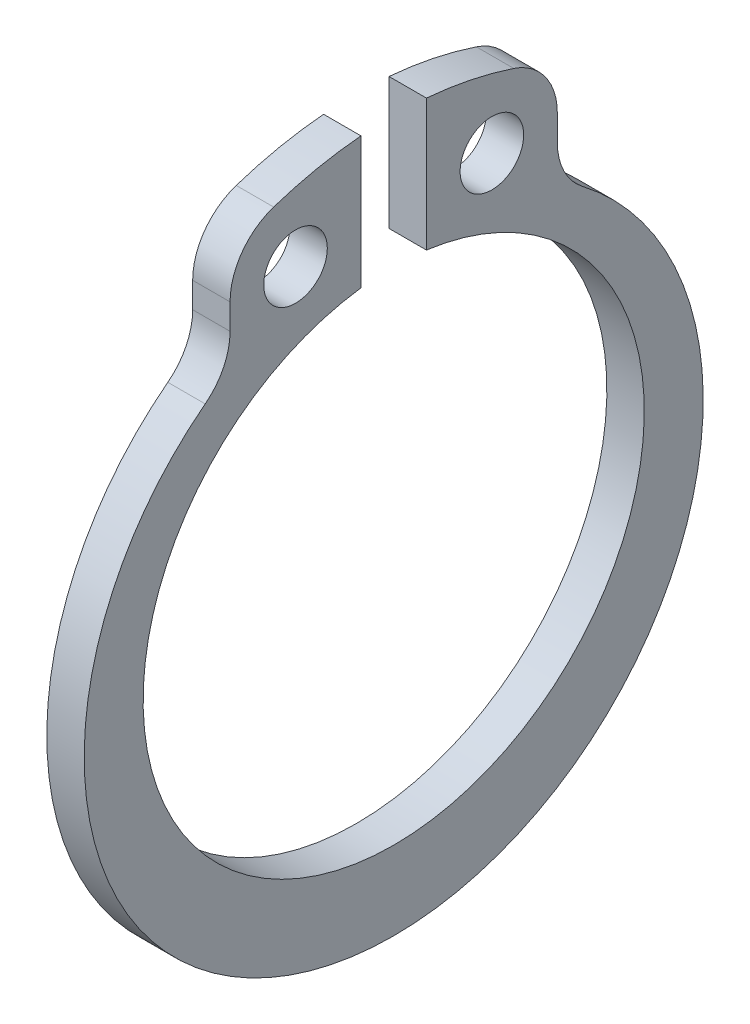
ISO-10303-21;
HEADER;
FILE_DESCRIPTION(('STEP AP214'),'2;1');
FILE_NAME('part.step','',(''),(''),'','','');
FILE_SCHEMA(('AUTOMOTIVE_DESIGN { 1 0 10303 214 1 1 1 1 }'));
ENDSEC;
DATA;
#1=APPLICATION_CONTEXT('core data for automotive mechanical design processes');
#2=APPLICATION_PROTOCOL_DEFINITION('international standard','automotive_design',2000,#1);
#3=PRODUCT_CONTEXT('',#1,'mechanical');
#4=PRODUCT('Part','Part','',(#3));
#5=PRODUCT_RELATED_PRODUCT_CATEGORY('part','',(#4));
#6=PRODUCT_DEFINITION_FORMATION('','',#4);
#7=PRODUCT_DEFINITION_CONTEXT('part definition',#1,'design');
#8=PRODUCT_DEFINITION('design','',#6,#7);
#9=PRODUCT_DEFINITION_SHAPE('','',#8);
#10=(LENGTH_UNIT() NAMED_UNIT(*) SI_UNIT(.MILLI.,.METRE.));
#11=(NAMED_UNIT(*) PLANE_ANGLE_UNIT() SI_UNIT($,.RADIAN.));
#12=(NAMED_UNIT(*) SI_UNIT($,.STERADIAN.) SOLID_ANGLE_UNIT());
#13=UNCERTAINTY_MEASURE_WITH_UNIT(LENGTH_MEASURE(1.E-05),#10,'distance_accuracy_value','');
#14=(GEOMETRIC_REPRESENTATION_CONTEXT(3) GLOBAL_UNCERTAINTY_ASSIGNED_CONTEXT((#13)) GLOBAL_UNIT_ASSIGNED_CONTEXT((#10,
#11,#12)) REPRESENTATION_CONTEXT('',''));
#15=CARTESIAN_POINT('',(0.,0.,0.));
#16=DIRECTION('',(0.,0.,1.));
#17=DIRECTION('',(1.,0.,0.));
#18=AXIS2_PLACEMENT_3D('',#15,#16,#17);
#19=CARTESIAN_POINT('',(1.,7.38670019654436,6.07500000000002));
#20=DIRECTION('',(-1.,0.,0.));
#21=DIRECTION('',(0.,0.,1.));
#22=AXIS2_PLACEMENT_3D('',#19,#20,#21);
#23=PLANE('',#22);
#24=CARTESIAN_POINT('',(1.,8.01040077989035,-2.625));
#25=DIRECTION('',(1.,0.,0.));
#26=DIRECTION('',(0.,0.,-1.));
#27=AXIS2_PLACEMENT_3D('',#24,#25,#26);
#28=CIRCLE('',#27,0.85);
#29=CARTESIAN_POINT('',(1.,8.01040077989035,-3.475));
#30=VERTEX_POINT('',#29);
#31=EDGE_CURVE('E153',#30,#30,#28,.T.);
#32=ORIENTED_EDGE('',*,*,#31,.F.);
#33=EDGE_LOOP('',(#32));
#34=FACE_BOUND('',#33,.T.);
#35=CARTESIAN_POINT('',(1.,7.38670019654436,6.07500000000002));
#36=DIRECTION('',(-1.,0.,0.));
#37=DIRECTION('',(0.,0.,1.));
#38=AXIS2_PLACEMENT_3D('',#35,#36,#37);
#39=CIRCLE('',#38,1.70000000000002);
#40=CARTESIAN_POINT('',(1.,7.38670019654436,4.375));
#41=VERTEX_POINT('',#40);
#42=CARTESIAN_POINT('',(1.,6.0383402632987,5.03966165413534));
#43=VERTEX_POINT('',#42);
#44=EDGE_CURVE('E172',#41,#43,#39,.T.);
#45=ORIENTED_EDGE('',*,*,#44,.T.);
#46=CARTESIAN_POINT('',(1.,-0.525,0.));
#47=DIRECTION('',(1.,0.,0.));
#48=DIRECTION('',(0.,0.,-1.));
#49=AXIS2_PLACEMENT_3D('',#46,#47,#48);
#50=CIRCLE('',#49,8.275);
#51=CARTESIAN_POINT('',(1.,6.0383402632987,-5.03966165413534));
#52=VERTEX_POINT('',#51);
#53=EDGE_CURVE('E100',#43,#52,#50,.T.);
#54=ORIENTED_EDGE('',*,*,#53,.T.);
#55=CARTESIAN_POINT('',(1.,7.38670019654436,-6.075));
#56=DIRECTION('',(-1.,0.,0.));
#57=DIRECTION('',(0.,0.,1.));
#58=AXIS2_PLACEMENT_3D('',#55,#56,#57);
#59=CIRCLE('',#58,1.7);
#60=CARTESIAN_POINT('',(1.,7.38670019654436,-4.375));
#61=VERTEX_POINT('',#60);
#62=EDGE_CURVE('E199',#52,#61,#59,.T.);
#63=ORIENTED_EDGE('',*,*,#62,.T.);
#64=DIRECTION('',(0.,1.,0.));
#65=VECTOR('',#64,1.);
#66=CARTESIAN_POINT('',(1.,7.38670019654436,-4.375));
#67=LINE('',#66,#65);
#68=CARTESIAN_POINT('',(1.,8.06810851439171,-4.375));
#69=VERTEX_POINT('',#68);
#70=EDGE_CURVE('E218',#61,#69,#67,.T.);
#71=ORIENTED_EDGE('',*,*,#70,.T.);
#72=CARTESIAN_POINT('',(1.,8.06810851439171,-2.675));
#73=DIRECTION('',(1.,0.,0.));
#74=DIRECTION('',(0.,0.,-1.));
#75=AXIS2_PLACEMENT_3D('',#72,#73,#74);
#76=CIRCLE('',#75,1.7);
#77=CARTESIAN_POINT('',(1.,9.68173020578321,-3.21000003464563));
#78=VERTEX_POINT('',#77);
#79=EDGE_CURVE('E215',#69,#78,#76,.T.);
#80=ORIENTED_EDGE('',*,*,#79,.T.);
#81=CARTESIAN_POINT('',(1.,-6.64399091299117E-13,1.35742111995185E-13));
#82=DIRECTION('',(1.,0.,0.));
#83=DIRECTION('',(0.,0.,-1.));
#84=AXIS2_PLACEMENT_3D('',#81,#82,#83);
#85=CIRCLE('',#84,10.2000000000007);
#86=CARTESIAN_POINT('',(1.,10.1624000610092,-0.874999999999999));
#87=VERTEX_POINT('',#86);
#88=EDGE_CURVE('E217',#78,#87,#85,.T.);
#89=ORIENTED_EDGE('',*,*,#88,.T.);
#90=DIRECTION('',(0.,-1.,0.));
#91=VECTOR('',#90,1.);
#92=CARTESIAN_POINT('',(1.,10.1624000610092,-0.874999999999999));
#93=LINE('',#92,#91);
#94=CARTESIAN_POINT('',(1.,6.64261808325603,-0.874999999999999));
#95=VERTEX_POINT('',#94);
#96=EDGE_CURVE('E220',#87,#95,#93,.T.);
#97=ORIENTED_EDGE('',*,*,#96,.T.);
#98=CARTESIAN_POINT('',(1.,-6.64399091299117E-13,1.35742111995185E-13));
#99=DIRECTION('',(-1.,0.,0.));
#100=DIRECTION('',(0.,0.,1.));
#101=AXIS2_PLACEMENT_3D('',#98,#99,#100);
#102=CIRCLE('',#101,6.70000000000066);
#103=CARTESIAN_POINT('',(1.,6.64261808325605,0.875000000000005));
#104=VERTEX_POINT('',#103);
#105=EDGE_CURVE('E226',#95,#104,#102,.T.);
#106=ORIENTED_EDGE('',*,*,#105,.T.);
#107=DIRECTION('',(0.,1.,0.));
#108=VECTOR('',#107,1.);
#109=CARTESIAN_POINT('',(1.,6.64261808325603,0.875000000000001));
#110=LINE('',#109,#108);
#111=CARTESIAN_POINT('',(1.,10.1624000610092,0.875000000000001));
#112=VERTEX_POINT('',#111);
#113=EDGE_CURVE('E131',#104,#112,#110,.T.);
#114=ORIENTED_EDGE('',*,*,#113,.T.);
#115=CARTESIAN_POINT('',(1.,-6.64399091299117E-13,1.35742111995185E-13));
#116=DIRECTION('',(1.,0.,0.));
#117=DIRECTION('',(0.,0.,-1.));
#118=AXIS2_PLACEMENT_3D('',#115,#116,#117);
#119=CIRCLE('',#118,10.2000000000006);
#120=CARTESIAN_POINT('',(1.,9.68173021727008,3.21000000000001));
#121=VERTEX_POINT('',#120);
#122=EDGE_CURVE('E125',#112,#121,#119,.T.);
#123=ORIENTED_EDGE('',*,*,#122,.T.);
#124=CARTESIAN_POINT('',(1.,8.06810851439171,2.675));
#125=DIRECTION('',(1.,0.,0.));
#126=DIRECTION('',(0.,0.,-1.));
#127=AXIS2_PLACEMENT_3D('',#124,#125,#126);
#128=CIRCLE('',#127,1.7);
#129=CARTESIAN_POINT('',(1.,8.06810851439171,4.375));
#130=VERTEX_POINT('',#129);
#131=EDGE_CURVE('E129',#121,#130,#128,.T.);
#132=ORIENTED_EDGE('',*,*,#131,.T.);
#133=DIRECTION('',(0.,-1.,0.));
#134=VECTOR('',#133,1.);
#135=CARTESIAN_POINT('',(1.,8.06810851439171,4.375));
#136=LINE('',#135,#134);
#137=EDGE_CURVE('E45',#130,#41,#136,.T.);
#138=ORIENTED_EDGE('',*,*,#137,.T.);
#139=EDGE_LOOP('',(#45,#54,#63,#71,#80,#89,#97,#106,#114,#123,#132,#138));
#140=FACE_BOUND('',#139,.T.);
#141=CARTESIAN_POINT('',(1.,8.01040077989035,2.625));
#142=DIRECTION('',(1.,0.,0.));
#143=DIRECTION('',(0.,0.,-1.));
#144=AXIS2_PLACEMENT_3D('',#141,#142,#143);
#145=CIRCLE('',#144,0.85);
#146=CARTESIAN_POINT('',(1.,8.01040077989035,1.775));
#147=VERTEX_POINT('',#146);
#148=EDGE_CURVE('E269',#147,#147,#145,.T.);
#149=ORIENTED_EDGE('',*,*,#148,.F.);
#150=EDGE_LOOP('',(#149));
#151=FACE_BOUND('',#150,.T.);
#152=ADVANCED_FACE('F28',(#34,#140,#151),#23,.F.);
#153=CARTESIAN_POINT('',(0.,7.38670019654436,6.07500000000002));
#154=DIRECTION('',(-1.,0.,0.));
#155=DIRECTION('',(0.,0.,1.));
#156=AXIS2_PLACEMENT_3D('',#153,#154,#155);
#157=PLANE('',#156);
#158=CARTESIAN_POINT('',(0.,8.01040077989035,-2.625));
#159=DIRECTION('',(1.,0.,0.));
#160=DIRECTION('',(0.,0.,-1.));
#161=AXIS2_PLACEMENT_3D('',#158,#159,#160);
#162=CIRCLE('',#161,0.85);
#163=CARTESIAN_POINT('',(0.,8.01040077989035,-3.475));
#164=VERTEX_POINT('',#163);
#165=EDGE_CURVE('E274',#164,#164,#162,.T.);
#166=ORIENTED_EDGE('',*,*,#165,.T.);
#167=EDGE_LOOP('',(#166));
#168=FACE_BOUND('',#167,.T.);
#169=CARTESIAN_POINT('',(0.,7.38670019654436,6.07500000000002));
#170=DIRECTION('',(-1.,0.,0.));
#171=DIRECTION('',(0.,0.,1.));
#172=AXIS2_PLACEMENT_3D('',#169,#170,#171);
#173=CIRCLE('',#172,1.70000000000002);
#174=CARTESIAN_POINT('',(0.,7.38670019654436,4.375));
#175=VERTEX_POINT('',#174);
#176=CARTESIAN_POINT('',(0.,6.0383402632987,5.03966165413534));
#177=VERTEX_POINT('',#176);
#178=EDGE_CURVE('E149',#175,#177,#173,.T.);
#179=ORIENTED_EDGE('',*,*,#178,.F.);
#180=DIRECTION('',(0.,-1.,0.));
#181=VECTOR('',#180,1.);
#182=CARTESIAN_POINT('',(0.,8.06810851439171,4.375));
#183=LINE('',#182,#181);
#184=CARTESIAN_POINT('',(0.,8.06810851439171,4.375));
#185=VERTEX_POINT('',#184);
#186=EDGE_CURVE('E92',#185,#175,#183,.T.);
#187=ORIENTED_EDGE('',*,*,#186,.F.);
#188=CARTESIAN_POINT('',(0.,8.06810851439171,2.675));
#189=DIRECTION('',(1.,0.,0.));
#190=DIRECTION('',(0.,0.,-1.));
#191=AXIS2_PLACEMENT_3D('',#188,#189,#190);
#192=CIRCLE('',#191,1.7);
#193=CARTESIAN_POINT('',(0.,9.68173021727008,3.21000000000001));
#194=VERTEX_POINT('',#193);
#195=EDGE_CURVE('E86',#194,#185,#192,.T.);
#196=ORIENTED_EDGE('',*,*,#195,.F.);
#197=CARTESIAN_POINT('',(0.,-6.64399091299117E-13,1.35742111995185E-13));
#198=DIRECTION('',(1.,0.,0.));
#199=DIRECTION('',(0.,0.,-1.));
#200=AXIS2_PLACEMENT_3D('',#197,#198,#199);
#201=CIRCLE('',#200,10.2000000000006);
#202=CARTESIAN_POINT('',(0.,10.1624000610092,0.875000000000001));
#203=VERTEX_POINT('',#202);
#204=EDGE_CURVE('E139',#203,#194,#201,.T.);
#205=ORIENTED_EDGE('',*,*,#204,.F.);
#206=DIRECTION('',(0.,1.,0.));
#207=VECTOR('',#206,1.);
#208=CARTESIAN_POINT('',(0.,6.64261808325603,0.875000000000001));
#209=LINE('',#208,#207);
#210=CARTESIAN_POINT('',(0.,6.64261808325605,0.875000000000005));
#211=VERTEX_POINT('',#210);
#212=EDGE_CURVE('E167',#211,#203,#209,.T.);
#213=ORIENTED_EDGE('',*,*,#212,.F.);
#214=CARTESIAN_POINT('',(0.,-6.64399091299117E-13,1.35742111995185E-13));
#215=DIRECTION('',(-1.,0.,0.));
#216=DIRECTION('',(0.,0.,1.));
#217=AXIS2_PLACEMENT_3D('',#214,#215,#216);
#218=CIRCLE('',#217,6.70000000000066);
#219=CARTESIAN_POINT('',(0.,6.64261808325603,-0.874999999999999));
#220=VERTEX_POINT('',#219);
#221=EDGE_CURVE('E165',#220,#211,#218,.T.);
#222=ORIENTED_EDGE('',*,*,#221,.F.);
#223=DIRECTION('',(0.,-1.,0.));
#224=VECTOR('',#223,1.);
#225=CARTESIAN_POINT('',(0.,10.1624000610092,-0.874999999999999));
#226=LINE('',#225,#224);
#227=CARTESIAN_POINT('',(0.,10.1624000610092,-0.874999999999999));
#228=VERTEX_POINT('',#227);
#229=EDGE_CURVE('E163',#228,#220,#226,.T.);
#230=ORIENTED_EDGE('',*,*,#229,.F.);
#231=CARTESIAN_POINT('',(0.,-6.64399091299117E-13,1.35742111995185E-13));
#232=DIRECTION('',(1.,0.,0.));
#233=DIRECTION('',(0.,0.,-1.));
#234=AXIS2_PLACEMENT_3D('',#231,#232,#233);
#235=CIRCLE('',#234,10.2000000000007);
#236=CARTESIAN_POINT('',(0.,9.68173020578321,-3.21000003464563));
#237=VERTEX_POINT('',#236);
#238=EDGE_CURVE('E161',#237,#228,#235,.T.);
#239=ORIENTED_EDGE('',*,*,#238,.F.);
#240=CARTESIAN_POINT('',(0.,8.06810851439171,-2.675));
#241=DIRECTION('',(1.,0.,0.));
#242=DIRECTION('',(0.,0.,-1.));
#243=AXIS2_PLACEMENT_3D('',#240,#241,#242);
#244=CIRCLE('',#243,1.7);
#245=CARTESIAN_POINT('',(0.,8.06810851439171,-4.375));
#246=VERTEX_POINT('',#245);
#247=EDGE_CURVE('E159',#246,#237,#244,.T.);
#248=ORIENTED_EDGE('',*,*,#247,.F.);
#249=DIRECTION('',(0.,1.,0.));
#250=VECTOR('',#249,1.);
#251=CARTESIAN_POINT('',(0.,7.38670019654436,-4.375));
#252=LINE('',#251,#250);
#253=CARTESIAN_POINT('',(0.,7.38670019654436,-4.375));
#254=VERTEX_POINT('',#253);
#255=EDGE_CURVE('E157',#254,#246,#252,.T.);
#256=ORIENTED_EDGE('',*,*,#255,.F.);
#257=CARTESIAN_POINT('',(0.,7.38670019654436,-6.075));
#258=DIRECTION('',(-1.,0.,0.));
#259=DIRECTION('',(0.,0.,1.));
#260=AXIS2_PLACEMENT_3D('',#257,#258,#259);
#261=CIRCLE('',#260,1.7);
#262=CARTESIAN_POINT('',(0.,6.0383402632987,-5.03966165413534));
#263=VERTEX_POINT('',#262);
#264=EDGE_CURVE('E155',#263,#254,#261,.T.);
#265=ORIENTED_EDGE('',*,*,#264,.F.);
#266=CARTESIAN_POINT('',(0.,-0.525,0.));
#267=DIRECTION('',(1.,0.,0.));
#268=DIRECTION('',(0.,0.,-1.));
#269=AXIS2_PLACEMENT_3D('',#266,#267,#268);
#270=CIRCLE('',#269,8.275);
#271=EDGE_CURVE('E152',#177,#263,#270,.T.);
#272=ORIENTED_EDGE('',*,*,#271,.F.);
#273=EDGE_LOOP('',(#179,#187,#196,#205,#213,#222,#230,#239,#248,#256,#265,#272));
#274=FACE_BOUND('',#273,.T.);
#275=CARTESIAN_POINT('',(0.,8.01040077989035,2.625));
#276=DIRECTION('',(1.,0.,0.));
#277=DIRECTION('',(0.,0.,-1.));
#278=AXIS2_PLACEMENT_3D('',#275,#276,#277);
#279=CIRCLE('',#278,0.85);
#280=CARTESIAN_POINT('',(0.,8.01040077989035,1.775));
#281=VERTEX_POINT('',#280);
#282=EDGE_CURVE('E272',#281,#281,#279,.T.);
#283=ORIENTED_EDGE('',*,*,#282,.T.);
#284=EDGE_LOOP('',(#283));
#285=FACE_BOUND('',#284,.T.);
#286=ADVANCED_FACE('F203',(#168,#274,#285),#157,.T.);
#287=CARTESIAN_POINT('',(1.,7.38670019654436,6.07500000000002));
#288=DIRECTION('',(-1.,0.,0.));
#289=DIRECTION('',(0.,0.,1.));
#290=AXIS2_PLACEMENT_3D('',#287,#288,#289);
#291=CYLINDRICAL_SURFACE('',#290,1.70000000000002);
#292=ORIENTED_EDGE('',*,*,#178,.T.);
#293=DIRECTION('',(-1.,0.,0.));
#294=VECTOR('',#293,1.);
#295=CARTESIAN_POINT('',(1.,6.0383402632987,5.03966165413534));
#296=LINE('',#295,#294);
#297=EDGE_CURVE('E11',#43,#177,#296,.T.);
#298=ORIENTED_EDGE('',*,*,#297,.F.);
#299=ORIENTED_EDGE('',*,*,#44,.F.);
#300=DIRECTION('',(-1.,0.,0.));
#301=VECTOR('',#300,1.);
#302=CARTESIAN_POINT('',(1.,7.38670019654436,4.375));
#303=LINE('',#302,#301);
#304=EDGE_CURVE('E145',#41,#175,#303,.T.);
#305=ORIENTED_EDGE('',*,*,#304,.T.);
#306=EDGE_LOOP('',(#292,#298,#299,#305));
#307=FACE_BOUND('',#306,.T.);
#308=ADVANCED_FACE('F30',(#307),#291,.F.);
#309=CARTESIAN_POINT('',(1.,-0.525,0.));
#310=DIRECTION('',(-1.,0.,0.));
#311=DIRECTION('',(0.,0.,1.));
#312=AXIS2_PLACEMENT_3D('',#309,#310,#311);
#313=CYLINDRICAL_SURFACE('',#312,8.275);
#314=ORIENTED_EDGE('',*,*,#271,.T.);
#315=DIRECTION('',(-1.,0.,0.));
#316=VECTOR('',#315,1.);
#317=CARTESIAN_POINT('',(1.,6.0383402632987,-5.03966165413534));
#318=LINE('',#317,#316);
#319=EDGE_CURVE('E37',#52,#263,#318,.T.);
#320=ORIENTED_EDGE('',*,*,#319,.F.);
#321=ORIENTED_EDGE('',*,*,#53,.F.);
#322=ORIENTED_EDGE('',*,*,#297,.T.);
#323=EDGE_LOOP('',(#314,#320,#321,#322));
#324=FACE_BOUND('',#323,.T.);
#325=ADVANCED_FACE('F367',(#324),#313,.T.);
#326=CARTESIAN_POINT('',(1.,7.38670019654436,-6.075));
#327=DIRECTION('',(-1.,0.,0.));
#328=DIRECTION('',(0.,0.,1.));
#329=AXIS2_PLACEMENT_3D('',#326,#327,#328);
#330=CYLINDRICAL_SURFACE('',#329,1.7);
#331=ORIENTED_EDGE('',*,*,#264,.T.);
#332=DIRECTION('',(-1.,0.,0.));
#333=VECTOR('',#332,1.);
#334=CARTESIAN_POINT('',(1.,7.38670019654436,-4.375));
#335=LINE('',#334,#333);
#336=EDGE_CURVE('E191',#61,#254,#335,.T.);
#337=ORIENTED_EDGE('',*,*,#336,.F.);
#338=ORIENTED_EDGE('',*,*,#62,.F.);
#339=ORIENTED_EDGE('',*,*,#319,.T.);
#340=EDGE_LOOP('',(#331,#337,#338,#339));
#341=FACE_BOUND('',#340,.T.);
#342=ADVANCED_FACE('F197',(#341),#330,.F.);
#343=CARTESIAN_POINT('',(1.,7.38670019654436,-4.375));
#344=DIRECTION('',(0.,0.,1.));
#345=DIRECTION('',(1.,0.,0.));
#346=AXIS2_PLACEMENT_3D('',#343,#344,#345);
#347=PLANE('',#346);
#348=ORIENTED_EDGE('',*,*,#255,.T.);
#349=DIRECTION('',(-1.,0.,0.));
#350=VECTOR('',#349,1.);
#351=CARTESIAN_POINT('',(1.,8.06810851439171,-4.375));
#352=LINE('',#351,#350);
#353=EDGE_CURVE('E188',#69,#246,#352,.T.);
#354=ORIENTED_EDGE('',*,*,#353,.F.);
#355=ORIENTED_EDGE('',*,*,#70,.F.);
#356=ORIENTED_EDGE('',*,*,#336,.T.);
#357=EDGE_LOOP('',(#348,#354,#355,#356));
#358=FACE_BOUND('',#357,.T.);
#359=ADVANCED_FACE('F209',(#358),#347,.F.);
#360=CARTESIAN_POINT('',(1.,8.06810851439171,-2.675));
#361=DIRECTION('',(-1.,0.,0.));
#362=DIRECTION('',(0.,0.,1.));
#363=AXIS2_PLACEMENT_3D('',#360,#361,#362);
#364=CYLINDRICAL_SURFACE('',#363,1.7);
#365=ORIENTED_EDGE('',*,*,#247,.T.);
#366=DIRECTION('',(-1.,0.,0.));
#367=VECTOR('',#366,1.);
#368=CARTESIAN_POINT('',(1.,9.68173020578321,-3.21000003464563));
#369=LINE('',#368,#367);
#370=EDGE_CURVE('E185',#78,#237,#369,.T.);
#371=ORIENTED_EDGE('',*,*,#370,.F.);
#372=ORIENTED_EDGE('',*,*,#79,.F.);
#373=ORIENTED_EDGE('',*,*,#353,.T.);
#374=EDGE_LOOP('',(#365,#371,#372,#373));
#375=FACE_BOUND('',#374,.T.);
#376=ADVANCED_FACE('F213',(#375),#364,.T.);
#377=CARTESIAN_POINT('',(1.,-6.64399091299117E-13,1.35742111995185E-13));
#378=DIRECTION('',(-1.,0.,0.));
#379=DIRECTION('',(0.,0.,1.));
#380=AXIS2_PLACEMENT_3D('',#377,#378,#379);
#381=CYLINDRICAL_SURFACE('',#380,10.2000000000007);
#382=ORIENTED_EDGE('',*,*,#238,.T.);
#383=DIRECTION('',(-1.,0.,0.));
#384=VECTOR('',#383,1.);
#385=CARTESIAN_POINT('',(1.,10.1624000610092,-0.874999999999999));
#386=LINE('',#385,#384);
#387=EDGE_CURVE('E182',#87,#228,#386,.T.);
#388=ORIENTED_EDGE('',*,*,#387,.F.);
#389=ORIENTED_EDGE('',*,*,#88,.F.);
#390=ORIENTED_EDGE('',*,*,#370,.T.);
#391=EDGE_LOOP('',(#382,#388,#389,#390));
#392=FACE_BOUND('',#391,.T.);
#393=ADVANCED_FACE('F332',(#392),#381,.T.);
#394=CARTESIAN_POINT('',(1.,10.1624000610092,-0.874999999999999));
#395=DIRECTION('',(0.,0.,-1.));
#396=DIRECTION('',(0.,1.,0.));
#397=AXIS2_PLACEMENT_3D('',#394,#395,#396);
#398=PLANE('',#397);
#399=ORIENTED_EDGE('',*,*,#229,.T.);
#400=DIRECTION('',(-1.,0.,0.));
#401=VECTOR('',#400,1.);
#402=CARTESIAN_POINT('',(1.,6.64261808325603,-0.874999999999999));
#403=LINE('',#402,#401);
#404=EDGE_CURVE('E179',#95,#220,#403,.T.);
#405=ORIENTED_EDGE('',*,*,#404,.F.);
#406=ORIENTED_EDGE('',*,*,#96,.F.);
#407=ORIENTED_EDGE('',*,*,#387,.T.);
#408=EDGE_LOOP('',(#399,#405,#406,#407));
#409=FACE_BOUND('',#408,.T.);
#410=ADVANCED_FACE('F323',(#409),#398,.F.);
#411=CARTESIAN_POINT('',(1.,-6.64399091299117E-13,1.35742111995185E-13));
#412=DIRECTION('',(-1.,0.,0.));
#413=DIRECTION('',(0.,0.,1.));
#414=AXIS2_PLACEMENT_3D('',#411,#412,#413);
#415=CYLINDRICAL_SURFACE('',#414,6.70000000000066);
#416=ORIENTED_EDGE('',*,*,#221,.T.);
#417=DIRECTION('',(-1.,0.,0.));
#418=VECTOR('',#417,1.);
#419=CARTESIAN_POINT('',(1.,6.64261808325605,0.875000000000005));
#420=LINE('',#419,#418);
#421=EDGE_CURVE('E176',#104,#211,#420,.T.);
#422=ORIENTED_EDGE('',*,*,#421,.F.);
#423=ORIENTED_EDGE('',*,*,#105,.F.);
#424=ORIENTED_EDGE('',*,*,#404,.T.);
#425=EDGE_LOOP('',(#416,#422,#423,#424));
#426=FACE_BOUND('',#425,.T.);
#427=ADVANCED_FACE('F232',(#426),#415,.F.);
#428=CARTESIAN_POINT('',(1.,6.64261808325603,0.875000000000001));
#429=DIRECTION('',(0.,0.,1.));
#430=DIRECTION('',(0.,-1.,0.));
#431=AXIS2_PLACEMENT_3D('',#428,#429,#430);
#432=PLANE('',#431);
#433=ORIENTED_EDGE('',*,*,#212,.T.);
#434=DIRECTION('',(-1.,0.,0.));
#435=VECTOR('',#434,1.);
#436=CARTESIAN_POINT('',(1.,10.1624000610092,0.875000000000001));
#437=LINE('',#436,#435);
#438=EDGE_CURVE('E140',#112,#203,#437,.T.);
#439=ORIENTED_EDGE('',*,*,#438,.F.);
#440=ORIENTED_EDGE('',*,*,#113,.F.);
#441=ORIENTED_EDGE('',*,*,#421,.T.);
#442=EDGE_LOOP('',(#433,#439,#440,#441));
#443=FACE_BOUND('',#442,.T.);
#444=ADVANCED_FACE('F236',(#443),#432,.F.);
#445=CARTESIAN_POINT('',(1.,-6.64399091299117E-13,1.35742111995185E-13));
#446=DIRECTION('',(-1.,0.,0.));
#447=DIRECTION('',(0.,0.,1.));
#448=AXIS2_PLACEMENT_3D('',#445,#446,#447);
#449=CYLINDRICAL_SURFACE('',#448,10.2000000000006);
#450=ORIENTED_EDGE('',*,*,#204,.T.);
#451=DIRECTION('',(-1.,0.,0.));
#452=VECTOR('',#451,1.);
#453=CARTESIAN_POINT('',(1.,9.68173021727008,3.21000000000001));
#454=LINE('',#453,#452);
#455=EDGE_CURVE('E136',#121,#194,#454,.T.);
#456=ORIENTED_EDGE('',*,*,#455,.F.);
#457=ORIENTED_EDGE('',*,*,#122,.F.);
#458=ORIENTED_EDGE('',*,*,#438,.T.);
#459=EDGE_LOOP('',(#450,#456,#457,#458));
#460=FACE_BOUND('',#459,.T.);
#461=ADVANCED_FACE('F137',(#460),#449,.T.);
#462=CARTESIAN_POINT('',(1.,8.06810851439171,2.675));
#463=DIRECTION('',(-1.,0.,0.));
#464=DIRECTION('',(0.,0.,1.));
#465=AXIS2_PLACEMENT_3D('',#462,#463,#464);
#466=CYLINDRICAL_SURFACE('',#465,1.7);
#467=ORIENTED_EDGE('',*,*,#195,.T.);
#468=DIRECTION('',(-1.,0.,0.));
#469=VECTOR('',#468,1.);
#470=CARTESIAN_POINT('',(1.,8.06810851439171,4.375));
#471=LINE('',#470,#469);
#472=EDGE_CURVE('E141',#130,#185,#471,.T.);
#473=ORIENTED_EDGE('',*,*,#472,.F.);
#474=ORIENTED_EDGE('',*,*,#131,.F.);
#475=ORIENTED_EDGE('',*,*,#455,.T.);
#476=EDGE_LOOP('',(#467,#473,#474,#475));
#477=FACE_BOUND('',#476,.T.);
#478=ADVANCED_FACE('F143',(#477),#466,.T.);
#479=CARTESIAN_POINT('',(1.,8.06810851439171,4.375));
#480=DIRECTION('',(0.,0.,-1.));
#481=DIRECTION('',(-1.,0.,0.));
#482=AXIS2_PLACEMENT_3D('',#479,#480,#481);
#483=PLANE('',#482);
#484=ORIENTED_EDGE('',*,*,#186,.T.);
#485=ORIENTED_EDGE('',*,*,#304,.F.);
#486=ORIENTED_EDGE('',*,*,#137,.F.);
#487=ORIENTED_EDGE('',*,*,#472,.T.);
#488=EDGE_LOOP('',(#484,#485,#486,#487));
#489=FACE_BOUND('',#488,.T.);
#490=ADVANCED_FACE('F240',(#489),#483,.F.);
#491=CARTESIAN_POINT('',(1.,8.01040077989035,-2.625));
#492=DIRECTION('',(-1.,0.,0.));
#493=DIRECTION('',(0.,0.,1.));
#494=AXIS2_PLACEMENT_3D('',#491,#492,#493);
#495=CYLINDRICAL_SURFACE('',#494,0.85);
#496=ORIENTED_EDGE('',*,*,#31,.T.);
#497=EDGE_LOOP('',(#496));
#498=FACE_BOUND('',#497,.T.);
#499=ORIENTED_EDGE('',*,*,#165,.F.);
#500=EDGE_LOOP('',(#499));
#501=FACE_BOUND('',#500,.T.);
#502=ADVANCED_FACE('F242',(#498,#501),#495,.F.);
#503=CARTESIAN_POINT('',(1.,8.01040077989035,2.625));
#504=DIRECTION('',(-1.,0.,0.));
#505=DIRECTION('',(0.,0.,1.));
#506=AXIS2_PLACEMENT_3D('',#503,#504,#505);
#507=CYLINDRICAL_SURFACE('',#506,0.85);
#508=ORIENTED_EDGE('',*,*,#148,.T.);
#509=EDGE_LOOP('',(#508));
#510=FACE_BOUND('',#509,.T.);
#511=ORIENTED_EDGE('',*,*,#282,.F.);
#512=EDGE_LOOP('',(#511));
#513=FACE_BOUND('',#512,.T.);
#514=ADVANCED_FACE('F248',(#510,#513),#507,.F.);
#515=CLOSED_SHELL('',(#152,#286,#308,#325,#342,#359,#376,#393,#410,#427,#444,#461,#478,#490,
#502,#514));
#516=MANIFOLD_SOLID_BREP('B2',#515);
#517=ADVANCED_BREP_SHAPE_REPRESENTATION('',(#18,#516),#14);
#518=SHAPE_DEFINITION_REPRESENTATION(#9,#517);
ENDSEC;
END-ISO-10303-21;
